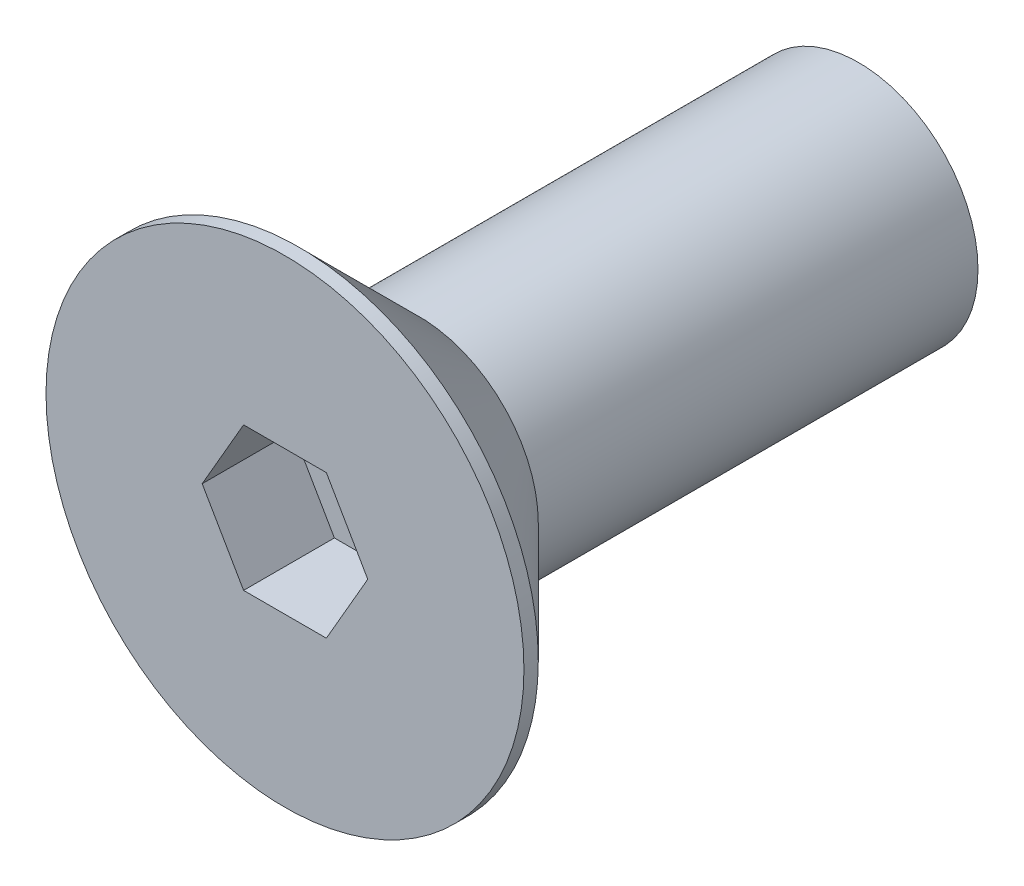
ISO-10303-21;
HEADER;
FILE_DESCRIPTION(('STEP AP214'),'2;1');
FILE_NAME('part.step','',(''),(''),'','','');
FILE_SCHEMA(('AUTOMOTIVE_DESIGN { 1 0 10303 214 1 1 1 1 }'));
ENDSEC;
DATA;
#1=APPLICATION_CONTEXT('core data for automotive mechanical design processes');
#2=APPLICATION_PROTOCOL_DEFINITION('international standard','automotive_design',2000,#1);
#3=PRODUCT_CONTEXT('',#1,'mechanical');
#4=PRODUCT('Part','Part','',(#3));
#5=PRODUCT_RELATED_PRODUCT_CATEGORY('part','',(#4));
#6=PRODUCT_DEFINITION_FORMATION('','',#4);
#7=PRODUCT_DEFINITION_CONTEXT('part definition',#1,'design');
#8=PRODUCT_DEFINITION('design','',#6,#7);
#9=PRODUCT_DEFINITION_SHAPE('','',#8);
#10=(LENGTH_UNIT() NAMED_UNIT(*) SI_UNIT(.MILLI.,.METRE.));
#11=(NAMED_UNIT(*) PLANE_ANGLE_UNIT() SI_UNIT($,.RADIAN.));
#12=(NAMED_UNIT(*) SI_UNIT($,.STERADIAN.) SOLID_ANGLE_UNIT());
#13=UNCERTAINTY_MEASURE_WITH_UNIT(LENGTH_MEASURE(1.E-05),#10,'distance_accuracy_value','');
#14=(GEOMETRIC_REPRESENTATION_CONTEXT(3) GLOBAL_UNCERTAINTY_ASSIGNED_CONTEXT((#13)) GLOBAL_UNIT_ASSIGNED_CONTEXT((#10,
#11,#12)) REPRESENTATION_CONTEXT('',''));
#15=CARTESIAN_POINT('',(0.,0.,0.));
#16=DIRECTION('',(0.,0.,1.));
#17=DIRECTION('',(1.,0.,0.));
#18=AXIS2_PLACEMENT_3D('',#15,#16,#17);
#19=CARTESIAN_POINT('',(0.,0.,-12.));
#20=DIRECTION('',(0.,0.,-1.));
#21=DIRECTION('',(-1.,0.,0.));
#22=AXIS2_PLACEMENT_3D('',#19,#20,#21);
#23=PLANE('',#22);
#24=CARTESIAN_POINT('',(0.,0.,-12.));
#25=DIRECTION('',(0.,0.,1.));
#26=DIRECTION('',(1.,0.,0.));
#27=AXIS2_PLACEMENT_3D('',#24,#25,#26);
#28=CIRCLE('',#27,2.5);
#29=CARTESIAN_POINT('',(2.5,0.,-12.));
#30=VERTEX_POINT('',#29);
#31=EDGE_CURVE('E21',#30,#30,#28,.T.);
#32=ORIENTED_EDGE('',*,*,#31,.F.);
#33=EDGE_LOOP('',(#32));
#34=FACE_BOUND('',#33,.T.);
#35=ADVANCED_FACE('F17',(#34),#23,.T.);
#36=CARTESIAN_POINT('',(0.,0.,0.));
#37=DIRECTION('',(0.,0.,1.));
#38=DIRECTION('',(1.,0.,0.));
#39=AXIS2_PLACEMENT_3D('',#36,#37,#38);
#40=CYLINDRICAL_SURFACE('',#39,2.5);
#41=CARTESIAN_POINT('',(0.,0.,-2.79999999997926));
#42=DIRECTION('',(0.,0.,1.));
#43=DIRECTION('',(1.,0.,0.));
#44=AXIS2_PLACEMENT_3D('',#41,#42,#43);
#45=CIRCLE('',#44,2.49999999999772);
#46=CARTESIAN_POINT('',(2.49999999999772,0.,-2.79999999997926));
#47=VERTEX_POINT('',#46);
#48=EDGE_CURVE('E127',#47,#47,#45,.T.);
#49=ORIENTED_EDGE('',*,*,#48,.F.);
#50=EDGE_LOOP('',(#49));
#51=FACE_BOUND('',#50,.T.);
#52=ORIENTED_EDGE('',*,*,#31,.T.);
#53=EDGE_LOOP('',(#52));
#54=FACE_BOUND('',#53,.T.);
#55=ADVANCED_FACE('F134',(#51,#54),#40,.T.);
#56=CARTESIAN_POINT('',(0.,0.,-0.299999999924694));
#57=DIRECTION('',(0.,0.,1.));
#58=DIRECTION('',(1.,0.,0.));
#59=AXIS2_PLACEMENT_3D('',#56,#57,#58);
#60=CONICAL_SURFACE('',#59,4.99999999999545,0.785398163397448);
#61=CARTESIAN_POINT('',(0.,0.,-0.3));
#62=DIRECTION('',(0.,0.,1.));
#63=DIRECTION('',(1.,0.,0.));
#64=AXIS2_PLACEMENT_3D('',#61,#62,#63);
#65=CIRCLE('',#64,5.);
#66=CARTESIAN_POINT('',(5.,0.,-0.3));
#67=VERTEX_POINT('',#66);
#68=EDGE_CURVE('E26',#67,#67,#65,.T.);
#69=ORIENTED_EDGE('',*,*,#68,.F.);
#70=EDGE_LOOP('',(#69));
#71=FACE_BOUND('',#70,.T.);
#72=ORIENTED_EDGE('',*,*,#48,.T.);
#73=EDGE_LOOP('',(#72));
#74=FACE_BOUND('',#73,.T.);
#75=ADVANCED_FACE('F144',(#71,#74),#60,.T.);
#76=CARTESIAN_POINT('',(0.,0.,0.));
#77=DIRECTION('',(0.,0.,1.));
#78=DIRECTION('',(1.,0.,0.));
#79=AXIS2_PLACEMENT_3D('',#76,#77,#78);
#80=CYLINDRICAL_SURFACE('',#79,5.);
#81=CARTESIAN_POINT('',(0.,0.,0.));
#82=DIRECTION('',(0.,0.,1.));
#83=DIRECTION('',(1.,0.,0.));
#84=AXIS2_PLACEMENT_3D('',#81,#82,#83);
#85=CIRCLE('',#84,5.);
#86=CARTESIAN_POINT('',(5.,0.,0.));
#87=VERTEX_POINT('',#86);
#88=EDGE_CURVE('E11',#87,#87,#85,.T.);
#89=ORIENTED_EDGE('',*,*,#88,.F.);
#90=EDGE_LOOP('',(#89));
#91=FACE_BOUND('',#90,.T.);
#92=ORIENTED_EDGE('',*,*,#68,.T.);
#93=EDGE_LOOP('',(#92));
#94=FACE_BOUND('',#93,.T.);
#95=ADVANCED_FACE('F151',(#91,#94),#80,.T.);
#96=CARTESIAN_POINT('',(5.,0.,0.));
#97=DIRECTION('',(0.,0.,1.));
#98=DIRECTION('',(1.,0.,0.));
#99=AXIS2_PLACEMENT_3D('',#96,#97,#98);
#100=PLANE('',#99);
#101=DIRECTION('',(0.5,0.866025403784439,0.));
#102=VECTOR('',#101,1.);
#103=CARTESIAN_POINT('',(0.866025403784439,-1.5,0.));
#104=LINE('',#103,#102);
#105=CARTESIAN_POINT('',(0.866025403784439,-1.5,0.));
#106=VERTEX_POINT('',#105);
#107=CARTESIAN_POINT('',(1.73205080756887,0.,0.));
#108=VERTEX_POINT('',#107);
#109=EDGE_CURVE('E33',#106,#108,#104,.T.);
#110=ORIENTED_EDGE('',*,*,#109,.F.);
#111=DIRECTION('',(1.,0.,0.));
#112=VECTOR('',#111,1.);
#113=CARTESIAN_POINT('',(-0.866025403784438,-1.5,0.));
#114=LINE('',#113,#112);
#115=CARTESIAN_POINT('',(-0.866025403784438,-1.5,0.));
#116=VERTEX_POINT('',#115);
#117=EDGE_CURVE('E116',#116,#106,#114,.T.);
#118=ORIENTED_EDGE('',*,*,#117,.F.);
#119=DIRECTION('',(0.5,-0.866025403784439,0.));
#120=VECTOR('',#119,1.);
#121=CARTESIAN_POINT('',(-1.73205080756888,0.,0.));
#122=LINE('',#121,#120);
#123=CARTESIAN_POINT('',(-1.73205080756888,0.,0.));
#124=VERTEX_POINT('',#123);
#125=EDGE_CURVE('E114',#124,#116,#122,.T.);
#126=ORIENTED_EDGE('',*,*,#125,.F.);
#127=DIRECTION('',(-0.5,-0.866025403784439,0.));
#128=VECTOR('',#127,1.);
#129=CARTESIAN_POINT('',(-0.866025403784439,1.5,0.));
#130=LINE('',#129,#128);
#131=CARTESIAN_POINT('',(-0.866025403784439,1.5,0.));
#132=VERTEX_POINT('',#131);
#133=EDGE_CURVE('E81',#132,#124,#130,.T.);
#134=ORIENTED_EDGE('',*,*,#133,.F.);
#135=DIRECTION('',(-1.,0.,0.));
#136=VECTOR('',#135,1.);
#137=CARTESIAN_POINT('',(0.866025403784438,1.5,0.));
#138=LINE('',#137,#136);
#139=CARTESIAN_POINT('',(0.866025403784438,1.5,0.));
#140=VERTEX_POINT('',#139);
#141=EDGE_CURVE('E110',#140,#132,#138,.T.);
#142=ORIENTED_EDGE('',*,*,#141,.F.);
#143=DIRECTION('',(-0.5,0.866025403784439,0.));
#144=VECTOR('',#143,1.);
#145=CARTESIAN_POINT('',(1.73205080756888,0.,0.));
#146=LINE('',#145,#144);
#147=EDGE_CURVE('E107',#108,#140,#146,.T.);
#148=ORIENTED_EDGE('',*,*,#147,.F.);
#149=EDGE_LOOP('',(#110,#118,#126,#134,#142,#148));
#150=FACE_BOUND('',#149,.T.);
#151=ORIENTED_EDGE('',*,*,#88,.T.);
#152=EDGE_LOOP('',(#151));
#153=FACE_BOUND('',#152,.T.);
#154=ADVANCED_FACE('F19',(#150,#153),#100,.T.);
#155=CARTESIAN_POINT('',(0.866025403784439,-1.5,-1.9));
#156=DIRECTION('',(0.866025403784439,-0.5,0.));
#157=DIRECTION('',(0.5,0.866025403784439,0.));
#158=AXIS2_PLACEMENT_3D('',#155,#156,#157);
#159=PLANE('',#158);
#160=ORIENTED_EDGE('',*,*,#109,.T.);
#161=DIRECTION('',(0.,0.,1.));
#162=VECTOR('',#161,1.);
#163=CARTESIAN_POINT('',(1.73205080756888,0.,-1.9));
#164=LINE('',#163,#162);
#165=CARTESIAN_POINT('',(1.73205080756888,0.,-1.9));
#166=VERTEX_POINT('',#165);
#167=EDGE_CURVE('E63',#166,#108,#164,.T.);
#168=ORIENTED_EDGE('',*,*,#167,.F.);
#169=DIRECTION('',(0.5,0.866025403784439,0.));
#170=VECTOR('',#169,1.);
#171=CARTESIAN_POINT('',(0.866025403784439,-1.5,-1.9));
#172=LINE('',#171,#170);
#173=CARTESIAN_POINT('',(0.866025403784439,-1.5,-1.9));
#174=VERTEX_POINT('',#173);
#175=EDGE_CURVE('E118',#174,#166,#172,.T.);
#176=ORIENTED_EDGE('',*,*,#175,.F.);
#177=DIRECTION('',(0.,0.,1.));
#178=VECTOR('',#177,1.);
#179=CARTESIAN_POINT('',(0.866025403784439,-1.5,-1.9));
#180=LINE('',#179,#178);
#181=EDGE_CURVE('E41',#174,#106,#180,.T.);
#182=ORIENTED_EDGE('',*,*,#181,.T.);
#183=EDGE_LOOP('',(#160,#168,#176,#182));
#184=FACE_BOUND('',#183,.T.);
#185=ADVANCED_FACE('F138',(#184),#159,.F.);
#186=CARTESIAN_POINT('',(-0.866025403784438,-1.5,-1.9));
#187=DIRECTION('',(0.,-1.,0.));
#188=DIRECTION('',(0.,0.,-1.));
#189=AXIS2_PLACEMENT_3D('',#186,#187,#188);
#190=PLANE('',#189);
#191=ORIENTED_EDGE('',*,*,#117,.T.);
#192=ORIENTED_EDGE('',*,*,#181,.F.);
#193=DIRECTION('',(1.,0.,0.));
#194=VECTOR('',#193,1.);
#195=CARTESIAN_POINT('',(-0.866025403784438,-1.5,-1.9));
#196=LINE('',#195,#194);
#197=CARTESIAN_POINT('',(-0.866025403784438,-1.5,-1.9));
#198=VERTEX_POINT('',#197);
#199=EDGE_CURVE('E93',#198,#174,#196,.T.);
#200=ORIENTED_EDGE('',*,*,#199,.F.);
#201=DIRECTION('',(0.,0.,1.));
#202=VECTOR('',#201,1.);
#203=CARTESIAN_POINT('',(-0.866025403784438,-1.5,-1.9));
#204=LINE('',#203,#202);
#205=EDGE_CURVE('E85',#198,#116,#204,.T.);
#206=ORIENTED_EDGE('',*,*,#205,.T.);
#207=EDGE_LOOP('',(#191,#192,#200,#206));
#208=FACE_BOUND('',#207,.T.);
#209=ADVANCED_FACE('F149',(#208),#190,.F.);
#210=CARTESIAN_POINT('',(-1.73205080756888,0.,-1.9));
#211=DIRECTION('',(-0.866025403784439,-0.5,0.));
#212=DIRECTION('',(0.5,-0.866025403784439,0.));
#213=AXIS2_PLACEMENT_3D('',#210,#211,#212);
#214=PLANE('',#213);
#215=ORIENTED_EDGE('',*,*,#125,.T.);
#216=ORIENTED_EDGE('',*,*,#205,.F.);
#217=DIRECTION('',(0.5,-0.866025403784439,0.));
#218=VECTOR('',#217,1.);
#219=CARTESIAN_POINT('',(-1.73205080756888,0.,-1.9));
#220=LINE('',#219,#218);
#221=CARTESIAN_POINT('',(-1.73205080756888,0.,-1.9));
#222=VERTEX_POINT('',#221);
#223=EDGE_CURVE('E89',#222,#198,#220,.T.);
#224=ORIENTED_EDGE('',*,*,#223,.F.);
#225=DIRECTION('',(0.,0.,1.));
#226=VECTOR('',#225,1.);
#227=CARTESIAN_POINT('',(-1.73205080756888,0.,-1.9));
#228=LINE('',#227,#226);
#229=EDGE_CURVE('E74',#222,#124,#228,.T.);
#230=ORIENTED_EDGE('',*,*,#229,.T.);
#231=EDGE_LOOP('',(#215,#216,#224,#230));
#232=FACE_BOUND('',#231,.T.);
#233=ADVANCED_FACE('F90',(#232),#214,.F.);
#234=CARTESIAN_POINT('',(-0.866025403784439,1.5,-1.9));
#235=DIRECTION('',(-0.866025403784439,0.5,0.));
#236=DIRECTION('',(-0.5,-0.866025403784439,0.));
#237=AXIS2_PLACEMENT_3D('',#234,#235,#236);
#238=PLANE('',#237);
#239=ORIENTED_EDGE('',*,*,#133,.T.);
#240=ORIENTED_EDGE('',*,*,#229,.F.);
#241=DIRECTION('',(-0.5,-0.866025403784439,0.));
#242=VECTOR('',#241,1.);
#243=CARTESIAN_POINT('',(-0.866025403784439,1.5,-1.9));
#244=LINE('',#243,#242);
#245=CARTESIAN_POINT('',(-0.866025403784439,1.5,-1.9));
#246=VERTEX_POINT('',#245);
#247=EDGE_CURVE('E78',#246,#222,#244,.T.);
#248=ORIENTED_EDGE('',*,*,#247,.F.);
#249=DIRECTION('',(0.,0.,1.));
#250=VECTOR('',#249,1.);
#251=CARTESIAN_POINT('',(-0.866025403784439,1.5,-1.9));
#252=LINE('',#251,#250);
#253=EDGE_CURVE('E86',#246,#132,#252,.T.);
#254=ORIENTED_EDGE('',*,*,#253,.T.);
#255=EDGE_LOOP('',(#239,#240,#248,#254));
#256=FACE_BOUND('',#255,.T.);
#257=ADVANCED_FACE('F76',(#256),#238,.F.);
#258=CARTESIAN_POINT('',(0.866025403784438,1.5,-1.9));
#259=DIRECTION('',(0.,1.,0.));
#260=DIRECTION('',(0.,0.,1.));
#261=AXIS2_PLACEMENT_3D('',#258,#259,#260);
#262=PLANE('',#261);
#263=ORIENTED_EDGE('',*,*,#141,.T.);
#264=ORIENTED_EDGE('',*,*,#253,.F.);
#265=DIRECTION('',(-1.,0.,0.));
#266=VECTOR('',#265,1.);
#267=CARTESIAN_POINT('',(0.866025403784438,1.5,-1.9));
#268=LINE('',#267,#266);
#269=CARTESIAN_POINT('',(0.866025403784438,1.5,-1.9));
#270=VERTEX_POINT('',#269);
#271=EDGE_CURVE('E99',#270,#246,#268,.T.);
#272=ORIENTED_EDGE('',*,*,#271,.F.);
#273=DIRECTION('',(0.,0.,1.));
#274=VECTOR('',#273,1.);
#275=CARTESIAN_POINT('',(0.866025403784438,1.5,-1.9));
#276=LINE('',#275,#274);
#277=EDGE_CURVE('E122',#270,#140,#276,.T.);
#278=ORIENTED_EDGE('',*,*,#277,.T.);
#279=EDGE_LOOP('',(#263,#264,#272,#278));
#280=FACE_BOUND('',#279,.T.);
#281=ADVANCED_FACE('F217',(#280),#262,.F.);
#282=CARTESIAN_POINT('',(1.73205080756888,0.,-1.9));
#283=DIRECTION('',(0.866025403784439,0.5,0.));
#284=DIRECTION('',(-0.5,0.866025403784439,0.));
#285=AXIS2_PLACEMENT_3D('',#282,#283,#284);
#286=PLANE('',#285);
#287=ORIENTED_EDGE('',*,*,#147,.T.);
#288=ORIENTED_EDGE('',*,*,#277,.F.);
#289=DIRECTION('',(-0.5,0.866025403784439,0.));
#290=VECTOR('',#289,1.);
#291=CARTESIAN_POINT('',(1.73205080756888,0.,-1.9));
#292=LINE('',#291,#290);
#293=EDGE_CURVE('E101',#166,#270,#292,.T.);
#294=ORIENTED_EDGE('',*,*,#293,.F.);
#295=ORIENTED_EDGE('',*,*,#167,.T.);
#296=EDGE_LOOP('',(#287,#288,#294,#295));
#297=FACE_BOUND('',#296,.T.);
#298=ADVANCED_FACE('F226',(#297),#286,.F.);
#299=CARTESIAN_POINT('',(0.,0.,-1.9));
#300=DIRECTION('',(0.,0.,1.));
#301=DIRECTION('',(1.,0.,0.));
#302=AXIS2_PLACEMENT_3D('',#299,#300,#301);
#303=PLANE('',#302);
#304=ORIENTED_EDGE('',*,*,#175,.T.);
#305=ORIENTED_EDGE('',*,*,#293,.T.);
#306=ORIENTED_EDGE('',*,*,#271,.T.);
#307=ORIENTED_EDGE('',*,*,#247,.T.);
#308=ORIENTED_EDGE('',*,*,#223,.T.);
#309=ORIENTED_EDGE('',*,*,#199,.T.);
#310=EDGE_LOOP('',(#304,#305,#306,#307,#308,#309));
#311=FACE_BOUND('',#310,.T.);
#312=ADVANCED_FACE('F96',(#311),#303,.T.);
#313=CLOSED_SHELL('',(#35,#55,#75,#95,#154,#185,#209,#233,#257,#281,#298,#312));
#314=MANIFOLD_SOLID_BREP('B1',#313);
#315=ADVANCED_BREP_SHAPE_REPRESENTATION('',(#18,#314),#14);
#316=SHAPE_DEFINITION_REPRESENTATION(#9,#315);
ENDSEC;
END-ISO-10303-21;
